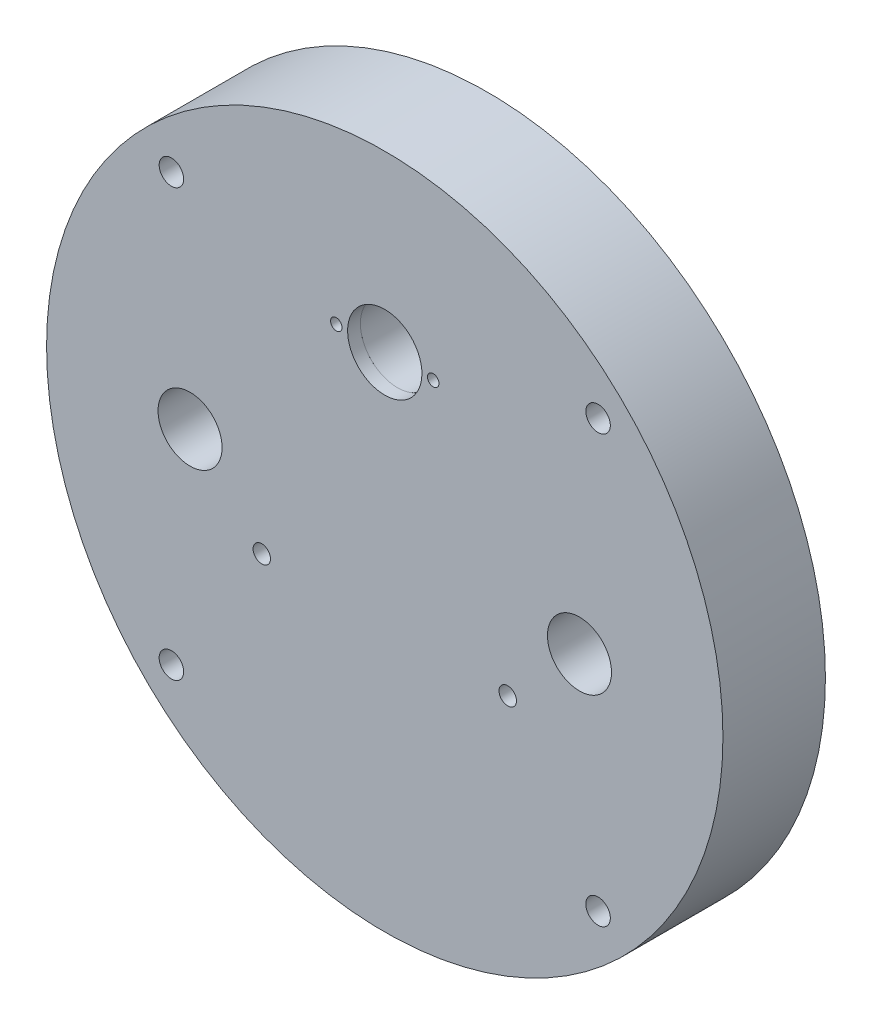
from build123d import *

# Parameters (mm, degrees)
SKETCH1_R                   = 52.3875
BOSS_EXTRUDE1_DEPTH         = 15.875
TAPPED_HOLE1_D              = 3.7973
F_7_16_20_TAPPED_HOLE1_D    = 9.92124
F_1_4_20_TAPPED_HOLE1_D     = 5.1054
F_1_4_20_TAPPED_HOLE1_DEPTH = 12.7
F_1_4_20_TAPPED_HOLE1_TIP   = 1.533816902
F_6_32_TAPPED_HOLE1_D       = 2.7051
F_6_32_TAPPED_HOLE1_DEPTH   = 12.7
F_6_32_TAPPED_HOLE1_TIP     = 0.81269403
SKETCH51_R                  = 5.7546875
THRU_HOLE_172_DEPTH         = 104.349650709
F_2_56_TAPPED_HOLE1_D       = 1.778
F_2_56_TAPPED_HOLE1_DEPTH   = 8.636
F_2_56_TAPPED_HOLE1_TIP     = 0.53416509


with BuildPart() as part:
    # Sketch1 → Boss-Extrude1 (new body)
    with BuildSketch(Plane.XY):
        Circle(SKETCH1_R)
    extrude(amount=BOSS_EXTRUDE1_DEPTH)

    # Tapped Hole1 (through all)
    with Locations(Plane(origin=(0, 0, 0), x_dir=(-1, 0, 0), z_dir=(0, 0, -1))):
        with Locations((33.047342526, -33.047342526), (-33.047342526, -33.047342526), (-33.047342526, 33.047342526), (33.047342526, 33.047342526)):
            Hole(TAPPED_HOLE1_D / 2)

    # 7_16-20 Tapped Hole1 (through all)
    with Locations(Plane.XY.offset(15.875)):
        with Locations((-30.1625, 0), (30.1625, 0)):
            Hole(F_7_16_20_TAPPED_HOLE1_D / 2)

    # 1_4-20 Tapped Hole1
    with Locations(Plane(origin=(0, 0, 0), x_dir=(-1, 0, 0), z_dir=(0, 0, -1))):
        with Locations((-19.05, -31.75), (0, -31.75), (19.05, -31.75)):
            Hole(F_1_4_20_TAPPED_HOLE1_D / 2, depth=F_1_4_20_TAPPED_HOLE1_DEPTH)
            with Locations((0, 0, -(F_1_4_20_TAPPED_HOLE1_DEPTH + F_1_4_20_TAPPED_HOLE1_TIP / 2))):  # 118° drill point
                Cone(0, F_1_4_20_TAPPED_HOLE1_D / 2, F_1_4_20_TAPPED_HOLE1_TIP, mode=Mode.SUBTRACT)

    # 6-32 Tapped Hole1
    with Locations(Plane.XY.offset(15.875)):
        with Locations((-19.05, -11.16584), (19.05, -11.16584)):
            Hole(F_6_32_TAPPED_HOLE1_D / 2, depth=F_6_32_TAPPED_HOLE1_DEPTH)
            with Locations((0, 0, -(F_6_32_TAPPED_HOLE1_DEPTH + F_6_32_TAPPED_HOLE1_TIP / 2))):  # 118° drill point
                Cone(0, F_6_32_TAPPED_HOLE1_D / 2, F_6_32_TAPPED_HOLE1_TIP, mode=Mode.SUBTRACT)

    # Sketch3 → SAE_5 (revolve, cut)
    with BuildSketch(Plane(origin=(0, 25.4, 0), x_dir=(0, 1, 0), z_dir=(1, 0, 0))):
        Polygon((0, 0), (0, 13.8938), (5.7531, 13.8938), (5.7531, 3.09199889), (6.48289889, 2.3622), (6.985, 0), align=None)
    revolve(axis=Axis((0, 25.4, -6.445314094), (0, 0, 1)), mode=Mode.SUBTRACT)

    # Sketch51 → Thru hole.172 (cut, through all)
    with BuildSketch(Plane(origin=(-27.380737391, 11.839759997, 13.8938), x_dir=(-1, 0, 0), z_dir=(0, 0, -1))):
        with Locations(Location((-27.380737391, 13.560240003, 0), (0, 0, 90))):
            Circle(SKETCH51_R)
    extrude(amount=-THRU_HOLE_172_DEPTH, mode=Mode.SUBTRACT)

    # 2-56 Tapped Hole1
    with Locations(Plane.XY.offset(15.875)):
        with Locations((-7.5057, 25.4), (7.5057, 25.4)):
            Hole(F_2_56_TAPPED_HOLE1_D / 2, depth=F_2_56_TAPPED_HOLE1_DEPTH)
            with Locations((0, 0, -(F_2_56_TAPPED_HOLE1_DEPTH + F_2_56_TAPPED_HOLE1_TIP / 2))):  # 118° drill point
                Cone(0, F_2_56_TAPPED_HOLE1_D / 2, F_2_56_TAPPED_HOLE1_TIP, mode=Mode.SUBTRACT)


solid = part.part
